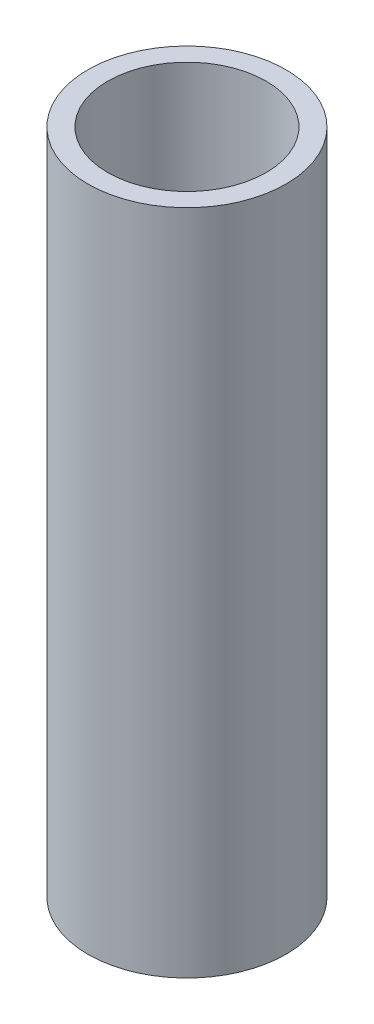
ISO-10303-21;
HEADER;
FILE_DESCRIPTION(('STEP AP214'),'2;1');
FILE_NAME('part.step','',(''),(''),'','','');
FILE_SCHEMA(('AUTOMOTIVE_DESIGN { 1 0 10303 214 1 1 1 1 }'));
ENDSEC;
DATA;
#1=APPLICATION_CONTEXT('core data for automotive mechanical design processes');
#2=APPLICATION_PROTOCOL_DEFINITION('international standard','automotive_design',2000,#1);
#3=PRODUCT_CONTEXT('',#1,'mechanical');
#4=PRODUCT('Part','Part','',(#3));
#5=PRODUCT_RELATED_PRODUCT_CATEGORY('part','',(#4));
#6=PRODUCT_DEFINITION_FORMATION('','',#4);
#7=PRODUCT_DEFINITION_CONTEXT('part definition',#1,'design');
#8=PRODUCT_DEFINITION('design','',#6,#7);
#9=PRODUCT_DEFINITION_SHAPE('','',#8);
#10=(LENGTH_UNIT() NAMED_UNIT(*) SI_UNIT(.MILLI.,.METRE.));
#11=(NAMED_UNIT(*) PLANE_ANGLE_UNIT() SI_UNIT($,.RADIAN.));
#12=(NAMED_UNIT(*) SI_UNIT($,.STERADIAN.) SOLID_ANGLE_UNIT());
#13=UNCERTAINTY_MEASURE_WITH_UNIT(LENGTH_MEASURE(1.E-05),#10,'distance_accuracy_value','');
#14=(GEOMETRIC_REPRESENTATION_CONTEXT(3) GLOBAL_UNCERTAINTY_ASSIGNED_CONTEXT((#13)) GLOBAL_UNIT_ASSIGNED_CONTEXT((#10,
#11,#12)) REPRESENTATION_CONTEXT('',''));
#15=CARTESIAN_POINT('',(0.,0.,0.));
#16=DIRECTION('',(0.,0.,1.));
#17=DIRECTION('',(1.,0.,0.));
#18=AXIS2_PLACEMENT_3D('',#15,#16,#17);
#19=CARTESIAN_POINT('',(0.,53.467,0.));
#20=DIRECTION('',(0.,1.,0.));
#21=DIRECTION('',(0.,0.,1.));
#22=AXIS2_PLACEMENT_3D('',#19,#20,#21);
#23=PLANE('',#22);
#24=CARTESIAN_POINT('',(0.,53.467,0.));
#25=DIRECTION('',(0.,1.,0.));
#26=DIRECTION('',(0.,0.,1.));
#27=AXIS2_PLACEMENT_3D('',#24,#25,#26);
#28=CIRCLE('',#27,15.875);
#29=CARTESIAN_POINT('',(0.,53.467,15.875));
#30=VERTEX_POINT('',#29);
#31=EDGE_CURVE('E10',#30,#30,#28,.T.);
#32=ORIENTED_EDGE('',*,*,#31,.T.);
#33=EDGE_LOOP('',(#32));
#34=FACE_BOUND('',#33,.T.);
#35=CARTESIAN_POINT('',(0.,53.467,0.));
#36=DIRECTION('',(0.,1.,0.));
#37=DIRECTION('',(0.,0.,1.));
#38=AXIS2_PLACEMENT_3D('',#35,#36,#37);
#39=CIRCLE('',#38,12.7);
#40=CARTESIAN_POINT('',(0.,53.467,12.7));
#41=VERTEX_POINT('',#40);
#42=EDGE_CURVE('E44',#41,#41,#39,.T.);
#43=ORIENTED_EDGE('',*,*,#42,.F.);
#44=EDGE_LOOP('',(#43));
#45=FACE_BOUND('',#44,.T.);
#46=ADVANCED_FACE('F33',(#34,#45),#23,.T.);
#47=CARTESIAN_POINT('',(0.,-53.467,0.));
#48=DIRECTION('',(0.,1.,0.));
#49=DIRECTION('',(0.,0.,1.));
#50=AXIS2_PLACEMENT_3D('',#47,#48,#49);
#51=PLANE('',#50);
#52=CARTESIAN_POINT('',(0.,-53.467,0.));
#53=DIRECTION('',(0.,1.,0.));
#54=DIRECTION('',(0.,0.,1.));
#55=AXIS2_PLACEMENT_3D('',#52,#53,#54);
#56=CIRCLE('',#55,15.875);
#57=CARTESIAN_POINT('',(0.,-53.467,15.875));
#58=VERTEX_POINT('',#57);
#59=EDGE_CURVE('E37',#58,#58,#56,.T.);
#60=ORIENTED_EDGE('',*,*,#59,.F.);
#61=EDGE_LOOP('',(#60));
#62=FACE_BOUND('',#61,.T.);
#63=CARTESIAN_POINT('',(0.,-53.467,0.));
#64=DIRECTION('',(0.,1.,0.));
#65=DIRECTION('',(0.,0.,1.));
#66=AXIS2_PLACEMENT_3D('',#63,#64,#65);
#67=CIRCLE('',#66,12.7);
#68=CARTESIAN_POINT('',(0.,-53.467,12.7));
#69=VERTEX_POINT('',#68);
#70=EDGE_CURVE('E46',#69,#69,#67,.T.);
#71=ORIENTED_EDGE('',*,*,#70,.T.);
#72=EDGE_LOOP('',(#71));
#73=FACE_BOUND('',#72,.T.);
#74=ADVANCED_FACE('F56',(#62,#73),#51,.F.);
#75=CARTESIAN_POINT('',(0.,53.467,0.));
#76=DIRECTION('',(0.,-1.,0.));
#77=DIRECTION('',(0.,0.,-1.));
#78=AXIS2_PLACEMENT_3D('',#75,#76,#77);
#79=CYLINDRICAL_SURFACE('',#78,15.875);
#80=ORIENTED_EDGE('',*,*,#31,.F.);
#81=EDGE_LOOP('',(#80));
#82=FACE_BOUND('',#81,.T.);
#83=ORIENTED_EDGE('',*,*,#59,.T.);
#84=EDGE_LOOP('',(#83));
#85=FACE_BOUND('',#84,.T.);
#86=ADVANCED_FACE('F35',(#82,#85),#79,.T.);
#87=CARTESIAN_POINT('',(0.,53.467,0.));
#88=DIRECTION('',(0.,-1.,0.));
#89=DIRECTION('',(0.,0.,-1.));
#90=AXIS2_PLACEMENT_3D('',#87,#88,#89);
#91=CYLINDRICAL_SURFACE('',#90,12.7);
#92=ORIENTED_EDGE('',*,*,#42,.T.);
#93=EDGE_LOOP('',(#92));
#94=FACE_BOUND('',#93,.T.);
#95=ORIENTED_EDGE('',*,*,#70,.F.);
#96=EDGE_LOOP('',(#95));
#97=FACE_BOUND('',#96,.T.);
#98=ADVANCED_FACE('F52',(#94,#97),#91,.F.);
#99=CLOSED_SHELL('',(#46,#74,#86,#98));
#100=MANIFOLD_SOLID_BREP('B2',#99);
#101=ADVANCED_BREP_SHAPE_REPRESENTATION('',(#18,#100),#14);
#102=SHAPE_DEFINITION_REPRESENTATION(#9,#101);
ENDSEC;
END-ISO-10303-21;
